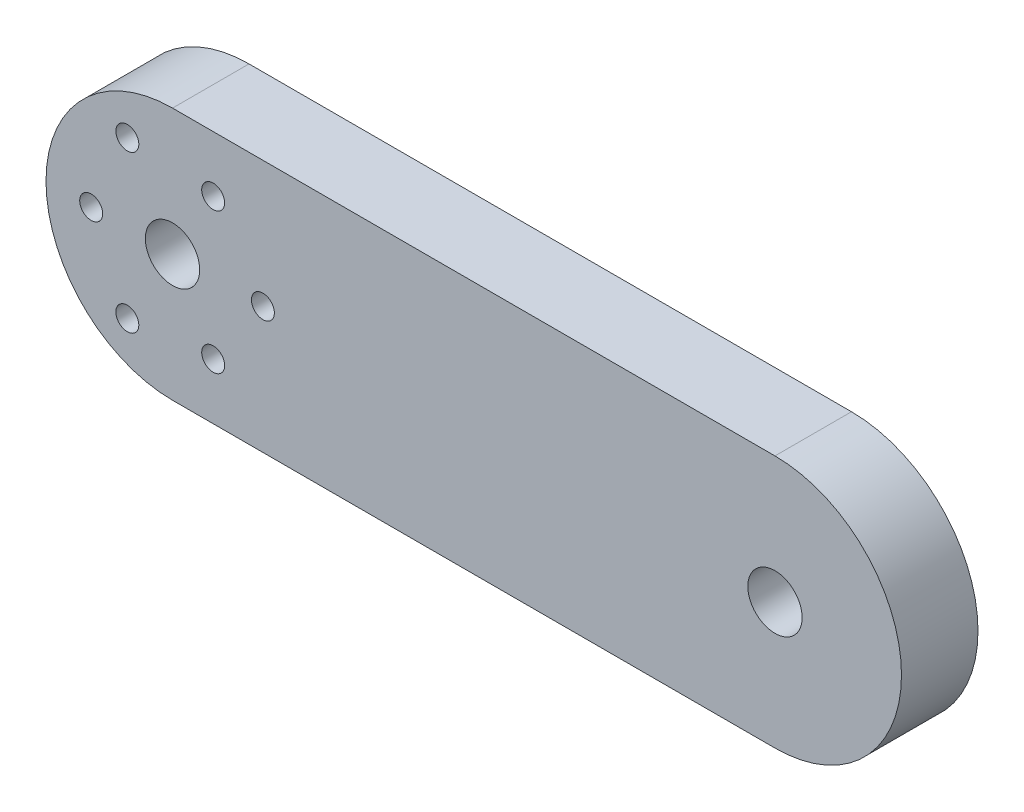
ISO-10303-21;
HEADER;
FILE_DESCRIPTION(('STEP AP214'),'2;1');
FILE_NAME('part.step','',(''),(''),'','','');
FILE_SCHEMA(('AUTOMOTIVE_DESIGN { 1 0 10303 214 1 1 1 1 }'));
ENDSEC;
DATA;
#1=APPLICATION_CONTEXT('core data for automotive mechanical design processes');
#2=APPLICATION_PROTOCOL_DEFINITION('international standard','automotive_design',2000,#1);
#3=PRODUCT_CONTEXT('',#1,'mechanical');
#4=PRODUCT('Part','Part','',(#3));
#5=PRODUCT_RELATED_PRODUCT_CATEGORY('part','',(#4));
#6=PRODUCT_DEFINITION_FORMATION('','',#4);
#7=PRODUCT_DEFINITION_CONTEXT('part definition',#1,'design');
#8=PRODUCT_DEFINITION('design','',#6,#7);
#9=PRODUCT_DEFINITION_SHAPE('','',#8);
#10=(LENGTH_UNIT() NAMED_UNIT(*) SI_UNIT(.MILLI.,.METRE.));
#11=(NAMED_UNIT(*) PLANE_ANGLE_UNIT() SI_UNIT($,.RADIAN.));
#12=(NAMED_UNIT(*) SI_UNIT($,.STERADIAN.) SOLID_ANGLE_UNIT());
#13=UNCERTAINTY_MEASURE_WITH_UNIT(LENGTH_MEASURE(1.E-05),#10,'distance_accuracy_value','');
#14=(GEOMETRIC_REPRESENTATION_CONTEXT(3) GLOBAL_UNCERTAINTY_ASSIGNED_CONTEXT((#13)) GLOBAL_UNIT_ASSIGNED_CONTEXT((#10,
#11,#12)) REPRESENTATION_CONTEXT('',''));
#15=CARTESIAN_POINT('',(0.,0.,0.));
#16=DIRECTION('',(0.,0.,1.));
#17=DIRECTION('',(1.,0.,0.));
#18=AXIS2_PLACEMENT_3D('',#15,#16,#17);
#19=CARTESIAN_POINT('',(0.,0.,12.7));
#20=DIRECTION('',(0.,0.,1.));
#21=DIRECTION('',(1.,0.,0.));
#22=AXIS2_PLACEMENT_3D('',#19,#20,#21);
#23=PLANE('',#22);
#24=CARTESIAN_POINT('',(6.75000000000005,11.6913429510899,12.7));
#25=DIRECTION('',(0.,0.,1.));
#26=DIRECTION('',(1.,0.,0.));
#27=AXIS2_PLACEMENT_3D('',#24,#25,#26);
#28=CIRCLE('',#27,1.905);
#29=CARTESIAN_POINT('',(8.65500000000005,11.6913429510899,12.7));
#30=VERTEX_POINT('',#29);
#31=EDGE_CURVE('E188',#30,#30,#28,.T.);
#32=ORIENTED_EDGE('',*,*,#31,.F.);
#33=EDGE_LOOP('',(#32));
#34=FACE_BOUND('',#33,.T.);
#35=CARTESIAN_POINT('',(-7.49999999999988,12.9903810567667,12.7));
#36=DIRECTION('',(0.,0.,1.));
#37=DIRECTION('',(1.,0.,0.));
#38=AXIS2_PLACEMENT_3D('',#35,#36,#37);
#39=CIRCLE('',#38,1.905);
#40=CARTESIAN_POINT('',(-5.59499999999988,12.9903810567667,12.7));
#41=VERTEX_POINT('',#40);
#42=EDGE_CURVE('E173',#41,#41,#39,.T.);
#43=ORIENTED_EDGE('',*,*,#42,.F.);
#44=EDGE_LOOP('',(#43));
#45=FACE_BOUND('',#44,.T.);
#46=CARTESIAN_POINT('',(0.,0.,12.7));
#47=DIRECTION('',(0.,0.,1.));
#48=DIRECTION('',(1.,0.,0.));
#49=AXIS2_PLACEMENT_3D('',#46,#47,#48);
#50=CIRCLE('',#49,4.5085);
#51=CARTESIAN_POINT('',(4.50850000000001,0.,12.7));
#52=VERTEX_POINT('',#51);
#53=EDGE_CURVE('E158',#52,#52,#50,.T.);
#54=ORIENTED_EDGE('',*,*,#53,.F.);
#55=EDGE_LOOP('',(#54));
#56=FACE_BOUND('',#55,.T.);
#57=CARTESIAN_POINT('',(100.,0.,12.7));
#58=DIRECTION('',(0.,0.,1.));
#59=DIRECTION('',(1.,0.,0.));
#60=AXIS2_PLACEMENT_3D('',#57,#58,#59);
#61=CIRCLE('',#60,4.5085);
#62=CARTESIAN_POINT('',(104.5085,0.,12.7));
#63=VERTEX_POINT('',#62);
#64=EDGE_CURVE('E126',#63,#63,#61,.T.);
#65=ORIENTED_EDGE('',*,*,#64,.F.);
#66=EDGE_LOOP('',(#65));
#67=FACE_BOUND('',#66,.T.);
#68=CARTESIAN_POINT('',(0.,0.,12.7));
#69=DIRECTION('',(0.,0.,1.));
#70=DIRECTION('',(1.,0.,0.));
#71=AXIS2_PLACEMENT_3D('',#68,#69,#70);
#72=CIRCLE('',#71,21.);
#73=CARTESIAN_POINT('',(0.,21.,12.7));
#74=VERTEX_POINT('',#73);
#75=CARTESIAN_POINT('',(0.,-21.,12.7));
#76=VERTEX_POINT('',#75);
#77=EDGE_CURVE('E103',#74,#76,#72,.T.);
#78=ORIENTED_EDGE('',*,*,#77,.T.);
#79=DIRECTION('',(1.,0.,0.));
#80=VECTOR('',#79,1.);
#81=CARTESIAN_POINT('',(0.,-21.,12.7));
#82=LINE('',#81,#80);
#83=CARTESIAN_POINT('',(100.,-21.,12.7));
#84=VERTEX_POINT('',#83);
#85=EDGE_CURVE('E98',#76,#84,#82,.T.);
#86=ORIENTED_EDGE('',*,*,#85,.T.);
#87=CARTESIAN_POINT('',(100.,0.,12.7));
#88=DIRECTION('',(0.,0.,1.));
#89=DIRECTION('',(1.,0.,0.));
#90=AXIS2_PLACEMENT_3D('',#87,#88,#89);
#91=CIRCLE('',#90,21.);
#92=CARTESIAN_POINT('',(100.,21.,12.7));
#93=VERTEX_POINT('',#92);
#94=EDGE_CURVE('E101',#84,#93,#91,.T.);
#95=ORIENTED_EDGE('',*,*,#94,.T.);
#96=DIRECTION('',(-1.,0.,0.));
#97=VECTOR('',#96,1.);
#98=CARTESIAN_POINT('',(0.,21.,12.7));
#99=LINE('',#98,#97);
#100=EDGE_CURVE('E68',#93,#74,#99,.T.);
#101=ORIENTED_EDGE('',*,*,#100,.T.);
#102=EDGE_LOOP('',(#78,#86,#95,#101));
#103=FACE_BOUND('',#102,.T.);
#104=CARTESIAN_POINT('',(15.,0.,12.7));
#105=DIRECTION('',(0.,0.,1.));
#106=DIRECTION('',(1.,0.,0.));
#107=AXIS2_PLACEMENT_3D('',#104,#105,#106);
#108=CIRCLE('',#107,1.905);
#109=CARTESIAN_POINT('',(16.905,0.,12.7));
#110=VERTEX_POINT('',#109);
#111=EDGE_CURVE('E151',#110,#110,#108,.T.);
#112=ORIENTED_EDGE('',*,*,#111,.F.);
#113=EDGE_LOOP('',(#112));
#114=FACE_BOUND('',#113,.T.);
#115=CARTESIAN_POINT('',(-7.50000000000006,-12.9903810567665,12.7));
#116=DIRECTION('',(0.,0.,1.));
#117=DIRECTION('',(1.,0.,0.));
#118=AXIS2_PLACEMENT_3D('',#115,#116,#117);
#119=CIRCLE('',#118,1.905);
#120=CARTESIAN_POINT('',(-5.59500000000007,-12.9903810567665,12.7));
#121=VERTEX_POINT('',#120);
#122=EDGE_CURVE('E166',#121,#121,#119,.T.);
#123=ORIENTED_EDGE('',*,*,#122,.F.);
#124=EDGE_LOOP('',(#123));
#125=FACE_BOUND('',#124,.T.);
#126=CARTESIAN_POINT('',(-13.5,0.,12.7));
#127=DIRECTION('',(0.,0.,1.));
#128=DIRECTION('',(1.,0.,0.));
#129=AXIS2_PLACEMENT_3D('',#126,#127,#128);
#130=CIRCLE('',#129,1.905);
#131=CARTESIAN_POINT('',(-11.595,0.,12.7));
#132=VERTEX_POINT('',#131);
#133=EDGE_CURVE('E180',#132,#132,#130,.T.);
#134=ORIENTED_EDGE('',*,*,#133,.F.);
#135=EDGE_LOOP('',(#134));
#136=FACE_BOUND('',#135,.T.);
#137=CARTESIAN_POINT('',(6.74999999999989,-11.69134295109,12.7));
#138=DIRECTION('',(0.,0.,1.));
#139=DIRECTION('',(1.,0.,0.));
#140=AXIS2_PLACEMENT_3D('',#137,#138,#139);
#141=CIRCLE('',#140,1.905);
#142=CARTESIAN_POINT('',(8.65499999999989,-11.69134295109,12.7));
#143=VERTEX_POINT('',#142);
#144=EDGE_CURVE('E196',#143,#143,#141,.T.);
#145=ORIENTED_EDGE('',*,*,#144,.F.);
#146=EDGE_LOOP('',(#145));
#147=FACE_BOUND('',#146,.T.);
#148=ADVANCED_FACE('F50',(#34,#45,#56,#67,#103,#114,#125,#136,#147),#23,.T.);
#149=CARTESIAN_POINT('',(0.,0.,0.));
#150=DIRECTION('',(0.,0.,1.));
#151=DIRECTION('',(1.,0.,0.));
#152=AXIS2_PLACEMENT_3D('',#149,#150,#151);
#153=PLANE('',#152);
#154=CARTESIAN_POINT('',(0.,0.,0.));
#155=DIRECTION('',(0.,0.,1.));
#156=DIRECTION('',(1.,0.,0.));
#157=AXIS2_PLACEMENT_3D('',#154,#155,#156);
#158=CIRCLE('',#157,21.);
#159=CARTESIAN_POINT('',(0.,21.,0.));
#160=VERTEX_POINT('',#159);
#161=CARTESIAN_POINT('',(0.,-21.,0.));
#162=VERTEX_POINT('',#161);
#163=EDGE_CURVE('E122',#160,#162,#158,.T.);
#164=ORIENTED_EDGE('',*,*,#163,.F.);
#165=DIRECTION('',(-1.,0.,0.));
#166=VECTOR('',#165,1.);
#167=CARTESIAN_POINT('',(0.,21.,0.));
#168=LINE('',#167,#166);
#169=CARTESIAN_POINT('',(100.,21.,0.));
#170=VERTEX_POINT('',#169);
#171=EDGE_CURVE('E91',#170,#160,#168,.T.);
#172=ORIENTED_EDGE('',*,*,#171,.F.);
#173=CARTESIAN_POINT('',(100.,0.,0.));
#174=DIRECTION('',(0.,0.,1.));
#175=DIRECTION('',(1.,0.,0.));
#176=AXIS2_PLACEMENT_3D('',#173,#174,#175);
#177=CIRCLE('',#176,21.);
#178=CARTESIAN_POINT('',(100.,-21.,0.));
#179=VERTEX_POINT('',#178);
#180=EDGE_CURVE('E85',#179,#170,#177,.T.);
#181=ORIENTED_EDGE('',*,*,#180,.F.);
#182=DIRECTION('',(1.,0.,0.));
#183=VECTOR('',#182,1.);
#184=CARTESIAN_POINT('',(0.,-21.,0.));
#185=LINE('',#184,#183);
#186=EDGE_CURVE('E108',#162,#179,#185,.T.);
#187=ORIENTED_EDGE('',*,*,#186,.F.);
#188=EDGE_LOOP('',(#164,#172,#181,#187));
#189=FACE_BOUND('',#188,.T.);
#190=CARTESIAN_POINT('',(100.,0.,0.));
#191=DIRECTION('',(0.,0.,1.));
#192=DIRECTION('',(1.,0.,0.));
#193=AXIS2_PLACEMENT_3D('',#190,#191,#192);
#194=CIRCLE('',#193,4.5085);
#195=CARTESIAN_POINT('',(104.5085,0.,0.));
#196=VERTEX_POINT('',#195);
#197=EDGE_CURVE('E147',#196,#196,#194,.T.);
#198=ORIENTED_EDGE('',*,*,#197,.T.);
#199=EDGE_LOOP('',(#198));
#200=FACE_BOUND('',#199,.T.);
#201=CARTESIAN_POINT('',(15.,0.,0.));
#202=DIRECTION('',(0.,0.,1.));
#203=DIRECTION('',(1.,0.,0.));
#204=AXIS2_PLACEMENT_3D('',#201,#202,#203);
#205=CIRCLE('',#204,1.905);
#206=CARTESIAN_POINT('',(16.905,0.,0.));
#207=VERTEX_POINT('',#206);
#208=EDGE_CURVE('E154',#207,#207,#205,.T.);
#209=ORIENTED_EDGE('',*,*,#208,.T.);
#210=EDGE_LOOP('',(#209));
#211=FACE_BOUND('',#210,.T.);
#212=CARTESIAN_POINT('',(0.,0.,0.));
#213=DIRECTION('',(0.,0.,1.));
#214=DIRECTION('',(1.,0.,0.));
#215=AXIS2_PLACEMENT_3D('',#212,#213,#214);
#216=CIRCLE('',#215,4.5085);
#217=CARTESIAN_POINT('',(4.50850000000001,0.,0.));
#218=VERTEX_POINT('',#217);
#219=EDGE_CURVE('E162',#218,#218,#216,.T.);
#220=ORIENTED_EDGE('',*,*,#219,.T.);
#221=EDGE_LOOP('',(#220));
#222=FACE_BOUND('',#221,.T.);
#223=CARTESIAN_POINT('',(-7.50000000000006,-12.9903810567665,0.));
#224=DIRECTION('',(0.,0.,1.));
#225=DIRECTION('',(1.,0.,0.));
#226=AXIS2_PLACEMENT_3D('',#223,#224,#225);
#227=CIRCLE('',#226,1.905);
#228=CARTESIAN_POINT('',(-5.59500000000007,-12.9903810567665,0.));
#229=VERTEX_POINT('',#228);
#230=EDGE_CURVE('E169',#229,#229,#227,.T.);
#231=ORIENTED_EDGE('',*,*,#230,.T.);
#232=EDGE_LOOP('',(#231));
#233=FACE_BOUND('',#232,.T.);
#234=CARTESIAN_POINT('',(-7.49999999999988,12.9903810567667,0.));
#235=DIRECTION('',(0.,0.,1.));
#236=DIRECTION('',(1.,0.,0.));
#237=AXIS2_PLACEMENT_3D('',#234,#235,#236);
#238=CIRCLE('',#237,1.905);
#239=CARTESIAN_POINT('',(-5.59499999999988,12.9903810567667,0.));
#240=VERTEX_POINT('',#239);
#241=EDGE_CURVE('E176',#240,#240,#238,.T.);
#242=ORIENTED_EDGE('',*,*,#241,.T.);
#243=EDGE_LOOP('',(#242));
#244=FACE_BOUND('',#243,.T.);
#245=CARTESIAN_POINT('',(-13.5,0.,0.));
#246=DIRECTION('',(0.,0.,1.));
#247=DIRECTION('',(1.,0.,0.));
#248=AXIS2_PLACEMENT_3D('',#245,#246,#247);
#249=CIRCLE('',#248,1.905);
#250=CARTESIAN_POINT('',(-11.595,0.,0.));
#251=VERTEX_POINT('',#250);
#252=EDGE_CURVE('E184',#251,#251,#249,.T.);
#253=ORIENTED_EDGE('',*,*,#252,.T.);
#254=EDGE_LOOP('',(#253));
#255=FACE_BOUND('',#254,.T.);
#256=CARTESIAN_POINT('',(6.75000000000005,11.6913429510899,0.));
#257=DIRECTION('',(0.,0.,1.));
#258=DIRECTION('',(1.,0.,0.));
#259=AXIS2_PLACEMENT_3D('',#256,#257,#258);
#260=CIRCLE('',#259,1.905);
#261=CARTESIAN_POINT('',(8.65500000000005,11.6913429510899,0.));
#262=VERTEX_POINT('',#261);
#263=EDGE_CURVE('E192',#262,#262,#260,.T.);
#264=ORIENTED_EDGE('',*,*,#263,.T.);
#265=EDGE_LOOP('',(#264));
#266=FACE_BOUND('',#265,.T.);
#267=CARTESIAN_POINT('',(6.74999999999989,-11.69134295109,0.));
#268=DIRECTION('',(0.,0.,1.));
#269=DIRECTION('',(1.,0.,0.));
#270=AXIS2_PLACEMENT_3D('',#267,#268,#269);
#271=CIRCLE('',#270,1.905);
#272=CARTESIAN_POINT('',(8.65499999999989,-11.69134295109,0.));
#273=VERTEX_POINT('',#272);
#274=EDGE_CURVE('E200',#273,#273,#271,.T.);
#275=ORIENTED_EDGE('',*,*,#274,.T.);
#276=EDGE_LOOP('',(#275));
#277=FACE_BOUND('',#276,.T.);
#278=ADVANCED_FACE('F141',(#189,#200,#211,#222,#233,#244,#255,#266,#277),#153,.F.);
#279=CARTESIAN_POINT('',(0.,0.,12.7));
#280=DIRECTION('',(0.,0.,-1.));
#281=DIRECTION('',(-1.,0.,0.));
#282=AXIS2_PLACEMENT_3D('',#279,#280,#281);
#283=CYLINDRICAL_SURFACE('',#282,21.);
#284=ORIENTED_EDGE('',*,*,#163,.T.);
#285=DIRECTION('',(0.,0.,-1.));
#286=VECTOR('',#285,1.);
#287=CARTESIAN_POINT('',(0.,-21.,12.7));
#288=LINE('',#287,#286);
#289=EDGE_CURVE('E11',#76,#162,#288,.T.);
#290=ORIENTED_EDGE('',*,*,#289,.F.);
#291=ORIENTED_EDGE('',*,*,#77,.F.);
#292=DIRECTION('',(0.,0.,-1.));
#293=VECTOR('',#292,1.);
#294=CARTESIAN_POINT('',(0.,21.,12.7));
#295=LINE('',#294,#293);
#296=EDGE_CURVE('E118',#74,#160,#295,.T.);
#297=ORIENTED_EDGE('',*,*,#296,.T.);
#298=EDGE_LOOP('',(#284,#290,#291,#297));
#299=FACE_BOUND('',#298,.T.);
#300=ADVANCED_FACE('F52',(#299),#283,.T.);
#301=CARTESIAN_POINT('',(0.,-21.,12.7));
#302=DIRECTION('',(0.,1.,0.));
#303=DIRECTION('',(0.,0.,1.));
#304=AXIS2_PLACEMENT_3D('',#301,#302,#303);
#305=PLANE('',#304);
#306=ORIENTED_EDGE('',*,*,#186,.T.);
#307=DIRECTION('',(0.,0.,-1.));
#308=VECTOR('',#307,1.);
#309=CARTESIAN_POINT('',(100.,-21.,12.7));
#310=LINE('',#309,#308);
#311=EDGE_CURVE('E60',#84,#179,#310,.T.);
#312=ORIENTED_EDGE('',*,*,#311,.F.);
#313=ORIENTED_EDGE('',*,*,#85,.F.);
#314=ORIENTED_EDGE('',*,*,#289,.T.);
#315=EDGE_LOOP('',(#306,#312,#313,#314));
#316=FACE_BOUND('',#315,.T.);
#317=ADVANCED_FACE('F107',(#316),#305,.F.);
#318=CARTESIAN_POINT('',(100.,0.,12.7));
#319=DIRECTION('',(0.,0.,-1.));
#320=DIRECTION('',(-1.,0.,0.));
#321=AXIS2_PLACEMENT_3D('',#318,#319,#320);
#322=CYLINDRICAL_SURFACE('',#321,21.);
#323=ORIENTED_EDGE('',*,*,#180,.T.);
#324=DIRECTION('',(0.,0.,-1.));
#325=VECTOR('',#324,1.);
#326=CARTESIAN_POINT('',(100.,21.,12.7));
#327=LINE('',#326,#325);
#328=EDGE_CURVE('E110',#93,#170,#327,.T.);
#329=ORIENTED_EDGE('',*,*,#328,.F.);
#330=ORIENTED_EDGE('',*,*,#94,.F.);
#331=ORIENTED_EDGE('',*,*,#311,.T.);
#332=EDGE_LOOP('',(#323,#329,#330,#331));
#333=FACE_BOUND('',#332,.T.);
#334=ADVANCED_FACE('F111',(#333),#322,.T.);
#335=CARTESIAN_POINT('',(0.,21.,12.7));
#336=DIRECTION('',(0.,-1.,0.));
#337=DIRECTION('',(0.,0.,-1.));
#338=AXIS2_PLACEMENT_3D('',#335,#336,#337);
#339=PLANE('',#338);
#340=ORIENTED_EDGE('',*,*,#171,.T.);
#341=ORIENTED_EDGE('',*,*,#296,.F.);
#342=ORIENTED_EDGE('',*,*,#100,.F.);
#343=ORIENTED_EDGE('',*,*,#328,.T.);
#344=EDGE_LOOP('',(#340,#341,#342,#343));
#345=FACE_BOUND('',#344,.T.);
#346=ADVANCED_FACE('F138',(#345),#339,.F.);
#347=CARTESIAN_POINT('',(100.,0.,12.7));
#348=DIRECTION('',(0.,0.,-1.));
#349=DIRECTION('',(-1.,0.,0.));
#350=AXIS2_PLACEMENT_3D('',#347,#348,#349);
#351=CYLINDRICAL_SURFACE('',#350,4.5085);
#352=ORIENTED_EDGE('',*,*,#64,.T.);
#353=EDGE_LOOP('',(#352));
#354=FACE_BOUND('',#353,.T.);
#355=ORIENTED_EDGE('',*,*,#197,.F.);
#356=EDGE_LOOP('',(#355));
#357=FACE_BOUND('',#356,.T.);
#358=ADVANCED_FACE('F221',(#354,#357),#351,.F.);
#359=CARTESIAN_POINT('',(15.,0.,12.7));
#360=DIRECTION('',(0.,0.,-1.));
#361=DIRECTION('',(-1.,0.,0.));
#362=AXIS2_PLACEMENT_3D('',#359,#360,#361);
#363=CYLINDRICAL_SURFACE('',#362,1.905);
#364=ORIENTED_EDGE('',*,*,#111,.T.);
#365=EDGE_LOOP('',(#364));
#366=FACE_BOUND('',#365,.T.);
#367=ORIENTED_EDGE('',*,*,#208,.F.);
#368=EDGE_LOOP('',(#367));
#369=FACE_BOUND('',#368,.T.);
#370=ADVANCED_FACE('F272',(#366,#369),#363,.F.);
#371=CARTESIAN_POINT('',(0.,0.,12.7));
#372=DIRECTION('',(0.,0.,-1.));
#373=DIRECTION('',(-1.,0.,0.));
#374=AXIS2_PLACEMENT_3D('',#371,#372,#373);
#375=CYLINDRICAL_SURFACE('',#374,4.5085);
#376=ORIENTED_EDGE('',*,*,#53,.T.);
#377=EDGE_LOOP('',(#376));
#378=FACE_BOUND('',#377,.T.);
#379=ORIENTED_EDGE('',*,*,#219,.F.);
#380=EDGE_LOOP('',(#379));
#381=FACE_BOUND('',#380,.T.);
#382=ADVANCED_FACE('F281',(#378,#381),#375,.F.);
#383=CARTESIAN_POINT('',(-7.50000000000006,-12.9903810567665,12.7));
#384=DIRECTION('',(0.,0.,-1.));
#385=DIRECTION('',(-1.,0.,0.));
#386=AXIS2_PLACEMENT_3D('',#383,#384,#385);
#387=CYLINDRICAL_SURFACE('',#386,1.905);
#388=ORIENTED_EDGE('',*,*,#122,.T.);
#389=EDGE_LOOP('',(#388));
#390=FACE_BOUND('',#389,.T.);
#391=ORIENTED_EDGE('',*,*,#230,.F.);
#392=EDGE_LOOP('',(#391));
#393=FACE_BOUND('',#392,.T.);
#394=ADVANCED_FACE('F290',(#390,#393),#387,.F.);
#395=CARTESIAN_POINT('',(-7.49999999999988,12.9903810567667,12.7));
#396=DIRECTION('',(0.,0.,-1.));
#397=DIRECTION('',(-1.,0.,0.));
#398=AXIS2_PLACEMENT_3D('',#395,#396,#397);
#399=CYLINDRICAL_SURFACE('',#398,1.905);
#400=ORIENTED_EDGE('',*,*,#42,.T.);
#401=EDGE_LOOP('',(#400));
#402=FACE_BOUND('',#401,.T.);
#403=ORIENTED_EDGE('',*,*,#241,.F.);
#404=EDGE_LOOP('',(#403));
#405=FACE_BOUND('',#404,.T.);
#406=ADVANCED_FACE('F300',(#402,#405),#399,.F.);
#407=CARTESIAN_POINT('',(-13.5,0.,12.7));
#408=DIRECTION('',(0.,0.,-1.));
#409=DIRECTION('',(-1.,0.,0.));
#410=AXIS2_PLACEMENT_3D('',#407,#408,#409);
#411=CYLINDRICAL_SURFACE('',#410,1.905);
#412=ORIENTED_EDGE('',*,*,#133,.T.);
#413=EDGE_LOOP('',(#412));
#414=FACE_BOUND('',#413,.T.);
#415=ORIENTED_EDGE('',*,*,#252,.F.);
#416=EDGE_LOOP('',(#415));
#417=FACE_BOUND('',#416,.T.);
#418=ADVANCED_FACE('F310',(#414,#417),#411,.F.);
#419=CARTESIAN_POINT('',(6.75000000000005,11.6913429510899,12.7));
#420=DIRECTION('',(0.,0.,-1.));
#421=DIRECTION('',(-1.,0.,0.));
#422=AXIS2_PLACEMENT_3D('',#419,#420,#421);
#423=CYLINDRICAL_SURFACE('',#422,1.905);
#424=ORIENTED_EDGE('',*,*,#31,.T.);
#425=EDGE_LOOP('',(#424));
#426=FACE_BOUND('',#425,.T.);
#427=ORIENTED_EDGE('',*,*,#263,.F.);
#428=EDGE_LOOP('',(#427));
#429=FACE_BOUND('',#428,.T.);
#430=ADVANCED_FACE('F320',(#426,#429),#423,.F.);
#431=CARTESIAN_POINT('',(6.74999999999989,-11.69134295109,12.7));
#432=DIRECTION('',(0.,0.,-1.));
#433=DIRECTION('',(-1.,0.,0.));
#434=AXIS2_PLACEMENT_3D('',#431,#432,#433);
#435=CYLINDRICAL_SURFACE('',#434,1.905);
#436=ORIENTED_EDGE('',*,*,#144,.T.);
#437=EDGE_LOOP('',(#436));
#438=FACE_BOUND('',#437,.T.);
#439=ORIENTED_EDGE('',*,*,#274,.F.);
#440=EDGE_LOOP('',(#439));
#441=FACE_BOUND('',#440,.T.);
#442=ADVANCED_FACE('F209',(#438,#441),#435,.F.);
#443=CLOSED_SHELL('',(#148,#278,#300,#317,#334,#346,#358,#370,#382,#394,#406,#418,#430,#442));
#444=MANIFOLD_SOLID_BREP('B2',#443);
#445=ADVANCED_BREP_SHAPE_REPRESENTATION('',(#18,#444),#14);
#446=SHAPE_DEFINITION_REPRESENTATION(#9,#445);
ENDSEC;
END-ISO-10303-21;
